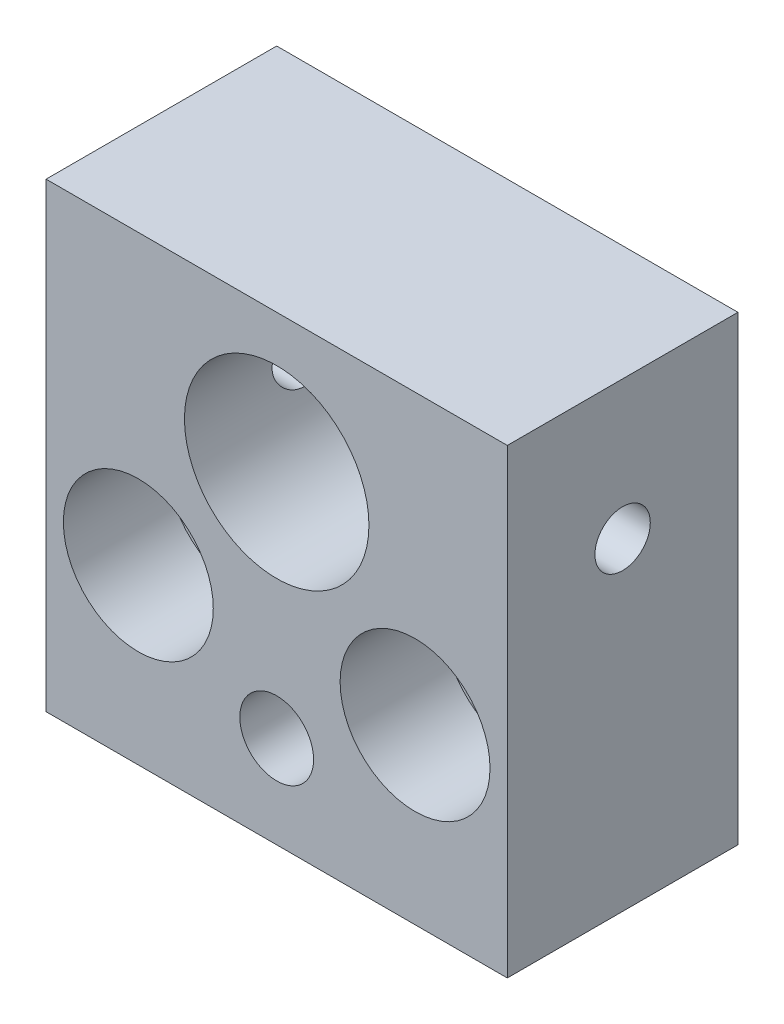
ISO-10303-21;
HEADER;
FILE_DESCRIPTION(('STEP AP214'),'2;1');
FILE_NAME('part.step','',(''),(''),'','','');
FILE_SCHEMA(('AUTOMOTIVE_DESIGN { 1 0 10303 214 1 1 1 1 }'));
ENDSEC;
DATA;
#1=APPLICATION_CONTEXT('core data for automotive mechanical design processes');
#2=APPLICATION_PROTOCOL_DEFINITION('international standard','automotive_design',2000,#1);
#3=PRODUCT_CONTEXT('',#1,'mechanical');
#4=PRODUCT('Part','Part','',(#3));
#5=PRODUCT_RELATED_PRODUCT_CATEGORY('part','',(#4));
#6=PRODUCT_DEFINITION_FORMATION('','',#4);
#7=PRODUCT_DEFINITION_CONTEXT('part definition',#1,'design');
#8=PRODUCT_DEFINITION('design','',#6,#7);
#9=PRODUCT_DEFINITION_SHAPE('','',#8);
#10=(LENGTH_UNIT() NAMED_UNIT(*) SI_UNIT(.MILLI.,.METRE.));
#11=(NAMED_UNIT(*) PLANE_ANGLE_UNIT() SI_UNIT($,.RADIAN.));
#12=(NAMED_UNIT(*) SI_UNIT($,.STERADIAN.) SOLID_ANGLE_UNIT());
#13=UNCERTAINTY_MEASURE_WITH_UNIT(LENGTH_MEASURE(1.E-05),#10,'distance_accuracy_value','');
#14=(GEOMETRIC_REPRESENTATION_CONTEXT(3) GLOBAL_UNCERTAINTY_ASSIGNED_CONTEXT((#13)) GLOBAL_UNIT_ASSIGNED_CONTEXT((#10,
#11,#12)) REPRESENTATION_CONTEXT('',''));
#15=CARTESIAN_POINT('',(0.,0.,0.));
#16=DIRECTION('',(0.,0.,1.));
#17=DIRECTION('',(1.,0.,0.));
#18=AXIS2_PLACEMENT_3D('',#15,#16,#17);
#19=CARTESIAN_POINT('',(-10.,18.5,10.));
#20=DIRECTION('',(0.,0.,1.));
#21=DIRECTION('',(1.,0.,0.));
#22=AXIS2_PLACEMENT_3D('',#19,#20,#21);
#23=PLANE('',#22);
#24=CARTESIAN_POINT('',(0.,22.5,10.));
#25=DIRECTION('',(0.,0.,1.));
#26=DIRECTION('',(1.,0.,0.));
#27=AXIS2_PLACEMENT_3D('',#24,#25,#26);
#28=CIRCLE('',#27,1.59999999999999);
#29=CARTESIAN_POINT('',(1.59999999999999,22.5,10.));
#30=VERTEX_POINT('',#29);
#31=EDGE_CURVE('E195',#30,#30,#28,.T.);
#32=ORIENTED_EDGE('',*,*,#31,.F.);
#33=EDGE_LOOP('',(#32));
#34=FACE_BOUND('',#33,.T.);
#35=CARTESIAN_POINT('',(-6.00000000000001,26.,10.));
#36=DIRECTION('',(0.,0.,1.));
#37=DIRECTION('',(1.,0.,0.));
#38=AXIS2_PLACEMENT_3D('',#35,#36,#37);
#39=CIRCLE('',#38,3.25);
#40=CARTESIAN_POINT('',(-2.75000000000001,26.,10.));
#41=VERTEX_POINT('',#40);
#42=EDGE_CURVE('E198',#41,#41,#39,.T.);
#43=ORIENTED_EDGE('',*,*,#42,.F.);
#44=EDGE_LOOP('',(#43));
#45=FACE_BOUND('',#44,.T.);
#46=CARTESIAN_POINT('',(6.,26.,10.));
#47=DIRECTION('',(0.,0.,1.));
#48=DIRECTION('',(1.,0.,0.));
#49=AXIS2_PLACEMENT_3D('',#46,#47,#48);
#50=CIRCLE('',#49,3.25);
#51=CARTESIAN_POINT('',(9.24999999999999,26.,10.));
#52=VERTEX_POINT('',#51);
#53=EDGE_CURVE('E210',#52,#52,#50,.T.);
#54=ORIENTED_EDGE('',*,*,#53,.F.);
#55=EDGE_LOOP('',(#54));
#56=FACE_BOUND('',#55,.T.);
#57=DIRECTION('',(0.,-1.,0.));
#58=VECTOR('',#57,1.);
#59=CARTESIAN_POINT('',(-10.,38.5,10.));
#60=LINE('',#59,#58);
#61=CARTESIAN_POINT('',(-10.,38.5,10.));
#62=VERTEX_POINT('',#61);
#63=CARTESIAN_POINT('',(-10.,18.5,10.));
#64=VERTEX_POINT('',#63);
#65=EDGE_CURVE('E103',#62,#64,#60,.T.);
#66=ORIENTED_EDGE('',*,*,#65,.T.);
#67=DIRECTION('',(1.,0.,0.));
#68=VECTOR('',#67,1.);
#69=CARTESIAN_POINT('',(-10.,18.5,10.));
#70=LINE('',#69,#68);
#71=CARTESIAN_POINT('',(10.,18.5,10.));
#72=VERTEX_POINT('',#71);
#73=EDGE_CURVE('E88',#64,#72,#70,.T.);
#74=ORIENTED_EDGE('',*,*,#73,.T.);
#75=DIRECTION('',(0.,1.,0.));
#76=VECTOR('',#75,1.);
#77=CARTESIAN_POINT('',(10.,38.5,10.));
#78=LINE('',#77,#76);
#79=CARTESIAN_POINT('',(10.,38.5,10.));
#80=VERTEX_POINT('',#79);
#81=EDGE_CURVE('E54',#72,#80,#78,.T.);
#82=ORIENTED_EDGE('',*,*,#81,.T.);
#83=DIRECTION('',(-1.,0.,0.));
#84=VECTOR('',#83,1.);
#85=CARTESIAN_POINT('',(-10.,38.5,10.));
#86=LINE('',#85,#84);
#87=EDGE_CURVE('E49',#80,#62,#86,.T.);
#88=ORIENTED_EDGE('',*,*,#87,.T.);
#89=EDGE_LOOP('',(#66,#74,#82,#88));
#90=FACE_BOUND('',#89,.T.);
#91=CARTESIAN_POINT('',(0.,32.5,10.));
#92=DIRECTION('',(0.,0.,1.));
#93=DIRECTION('',(1.,0.,0.));
#94=AXIS2_PLACEMENT_3D('',#91,#92,#93);
#95=CIRCLE('',#94,4.);
#96=CARTESIAN_POINT('',(4.,32.5,10.));
#97=VERTEX_POINT('',#96);
#98=EDGE_CURVE('E93',#97,#97,#95,.T.);
#99=ORIENTED_EDGE('',*,*,#98,.F.);
#100=EDGE_LOOP('',(#99));
#101=FACE_BOUND('',#100,.T.);
#102=ADVANCED_FACE('F28',(#34,#45,#56,#90,#101),#23,.T.);
#103=CARTESIAN_POINT('',(-10.,18.5,0.));
#104=DIRECTION('',(0.,0.,1.));
#105=DIRECTION('',(1.,0.,0.));
#106=AXIS2_PLACEMENT_3D('',#103,#104,#105);
#107=PLANE('',#106);
#108=CARTESIAN_POINT('',(0.,22.5,0.));
#109=DIRECTION('',(0.,0.,1.));
#110=DIRECTION('',(1.,0.,0.));
#111=AXIS2_PLACEMENT_3D('',#108,#109,#110);
#112=CIRCLE('',#111,1.6);
#113=CARTESIAN_POINT('',(1.6,22.5,0.));
#114=VERTEX_POINT('',#113);
#115=EDGE_CURVE('E192',#114,#114,#112,.T.);
#116=ORIENTED_EDGE('',*,*,#115,.T.);
#117=EDGE_LOOP('',(#116));
#118=FACE_BOUND('',#117,.T.);
#119=CARTESIAN_POINT('',(-6.00000000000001,26.,0.));
#120=DIRECTION('',(0.,0.,1.));
#121=DIRECTION('',(1.,0.,0.));
#122=AXIS2_PLACEMENT_3D('',#119,#120,#121);
#123=CIRCLE('',#122,1.7);
#124=CARTESIAN_POINT('',(-4.30000000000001,26.,0.));
#125=VERTEX_POINT('',#124);
#126=EDGE_CURVE('E207',#125,#125,#123,.T.);
#127=ORIENTED_EDGE('',*,*,#126,.T.);
#128=EDGE_LOOP('',(#127));
#129=FACE_BOUND('',#128,.T.);
#130=CARTESIAN_POINT('',(6.,26.,0.));
#131=DIRECTION('',(0.,0.,1.));
#132=DIRECTION('',(1.,0.,0.));
#133=AXIS2_PLACEMENT_3D('',#130,#131,#132);
#134=CIRCLE('',#133,1.7);
#135=CARTESIAN_POINT('',(7.7,26.,0.));
#136=VERTEX_POINT('',#135);
#137=EDGE_CURVE('E219',#136,#136,#134,.T.);
#138=ORIENTED_EDGE('',*,*,#137,.T.);
#139=EDGE_LOOP('',(#138));
#140=FACE_BOUND('',#139,.T.);
#141=DIRECTION('',(0.,-1.,0.));
#142=VECTOR('',#141,1.);
#143=CARTESIAN_POINT('',(-10.,38.5,0.));
#144=LINE('',#143,#142);
#145=CARTESIAN_POINT('',(-10.,38.5,0.));
#146=VERTEX_POINT('',#145);
#147=CARTESIAN_POINT('',(-10.,18.5,0.));
#148=VERTEX_POINT('',#147);
#149=EDGE_CURVE('E80',#146,#148,#144,.T.);
#150=ORIENTED_EDGE('',*,*,#149,.F.);
#151=DIRECTION('',(-1.,0.,0.));
#152=VECTOR('',#151,1.);
#153=CARTESIAN_POINT('',(-10.,38.5,0.));
#154=LINE('',#153,#152);
#155=CARTESIAN_POINT('',(10.,38.5,0.));
#156=VERTEX_POINT('',#155);
#157=EDGE_CURVE('E101',#156,#146,#154,.T.);
#158=ORIENTED_EDGE('',*,*,#157,.F.);
#159=DIRECTION('',(0.,1.,0.));
#160=VECTOR('',#159,1.);
#161=CARTESIAN_POINT('',(10.,38.5,0.));
#162=LINE('',#161,#160);
#163=CARTESIAN_POINT('',(10.,18.5,0.));
#164=VERTEX_POINT('',#163);
#165=EDGE_CURVE('E81',#164,#156,#162,.T.);
#166=ORIENTED_EDGE('',*,*,#165,.F.);
#167=DIRECTION('',(1.,0.,0.));
#168=VECTOR('',#167,1.);
#169=CARTESIAN_POINT('',(-10.,18.5,0.));
#170=LINE('',#169,#168);
#171=EDGE_CURVE('E75',#148,#164,#170,.T.);
#172=ORIENTED_EDGE('',*,*,#171,.F.);
#173=EDGE_LOOP('',(#150,#158,#166,#172));
#174=FACE_BOUND('',#173,.T.);
#175=CARTESIAN_POINT('',(0.,32.5,0.));
#176=DIRECTION('',(0.,0.,1.));
#177=DIRECTION('',(1.,0.,0.));
#178=AXIS2_PLACEMENT_3D('',#175,#176,#177);
#179=CIRCLE('',#178,4.);
#180=CARTESIAN_POINT('',(4.,32.5,0.));
#181=VERTEX_POINT('',#180);
#182=EDGE_CURVE('E96',#181,#181,#179,.T.);
#183=ORIENTED_EDGE('',*,*,#182,.T.);
#184=EDGE_LOOP('',(#183));
#185=FACE_BOUND('',#184,.T.);
#186=ADVANCED_FACE('F76',(#118,#129,#140,#174,#185),#107,.F.);
#187=CARTESIAN_POINT('',(-10.,38.5,10.));
#188=DIRECTION('',(1.,0.,0.));
#189=DIRECTION('',(0.,0.,-1.));
#190=AXIS2_PLACEMENT_3D('',#187,#188,#189);
#191=PLANE('',#190);
#192=CARTESIAN_POINT('',(-10.,32.5,5.));
#193=DIRECTION('',(1.,0.,0.));
#194=DIRECTION('',(0.,0.,-1.));
#195=AXIS2_PLACEMENT_3D('',#192,#193,#194);
#196=CIRCLE('',#195,1.19999999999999);
#197=CARTESIAN_POINT('',(-10.,32.5,3.80000000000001));
#198=VERTEX_POINT('',#197);
#199=EDGE_CURVE('E186',#198,#198,#196,.T.);
#200=ORIENTED_EDGE('',*,*,#199,.T.);
#201=EDGE_LOOP('',(#200));
#202=FACE_BOUND('',#201,.T.);
#203=ORIENTED_EDGE('',*,*,#149,.T.);
#204=DIRECTION('',(0.,0.,-1.));
#205=VECTOR('',#204,1.);
#206=CARTESIAN_POINT('',(-10.,18.5,10.));
#207=LINE('',#206,#205);
#208=EDGE_CURVE('E11',#64,#148,#207,.T.);
#209=ORIENTED_EDGE('',*,*,#208,.F.);
#210=ORIENTED_EDGE('',*,*,#65,.F.);
#211=DIRECTION('',(0.,0.,-1.));
#212=VECTOR('',#211,1.);
#213=CARTESIAN_POINT('',(-10.,38.5,10.));
#214=LINE('',#213,#212);
#215=EDGE_CURVE('E92',#62,#146,#214,.T.);
#216=ORIENTED_EDGE('',*,*,#215,.T.);
#217=EDGE_LOOP('',(#203,#209,#210,#216));
#218=FACE_BOUND('',#217,.T.);
#219=ADVANCED_FACE('F30',(#202,#218),#191,.F.);
#220=CARTESIAN_POINT('',(-10.,18.5,10.));
#221=DIRECTION('',(0.,1.,0.));
#222=DIRECTION('',(0.,0.,1.));
#223=AXIS2_PLACEMENT_3D('',#220,#221,#222);
#224=PLANE('',#223);
#225=ORIENTED_EDGE('',*,*,#171,.T.);
#226=DIRECTION('',(0.,0.,-1.));
#227=VECTOR('',#226,1.);
#228=CARTESIAN_POINT('',(10.,18.5,10.));
#229=LINE('',#228,#227);
#230=EDGE_CURVE('E41',#72,#164,#229,.T.);
#231=ORIENTED_EDGE('',*,*,#230,.F.);
#232=ORIENTED_EDGE('',*,*,#73,.F.);
#233=ORIENTED_EDGE('',*,*,#208,.T.);
#234=EDGE_LOOP('',(#225,#231,#232,#233));
#235=FACE_BOUND('',#234,.T.);
#236=ADVANCED_FACE('F87',(#235),#224,.F.);
#237=CARTESIAN_POINT('',(10.,38.5,10.));
#238=DIRECTION('',(-1.,0.,0.));
#239=DIRECTION('',(0.,-1.,0.));
#240=AXIS2_PLACEMENT_3D('',#237,#238,#239);
#241=PLANE('',#240);
#242=CARTESIAN_POINT('',(10.,32.5,5.));
#243=DIRECTION('',(1.,0.,0.));
#244=DIRECTION('',(0.,0.,-1.));
#245=AXIS2_PLACEMENT_3D('',#242,#243,#244);
#246=CIRCLE('',#245,1.19999999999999);
#247=CARTESIAN_POINT('',(10.,32.5,3.80000000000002));
#248=VERTEX_POINT('',#247);
#249=EDGE_CURVE('E116',#248,#248,#246,.T.);
#250=ORIENTED_EDGE('',*,*,#249,.F.);
#251=EDGE_LOOP('',(#250));
#252=FACE_BOUND('',#251,.T.);
#253=ORIENTED_EDGE('',*,*,#165,.T.);
#254=DIRECTION('',(0.,0.,-1.));
#255=VECTOR('',#254,1.);
#256=CARTESIAN_POINT('',(10.,38.5,10.));
#257=LINE('',#256,#255);
#258=EDGE_CURVE('E109',#80,#156,#257,.T.);
#259=ORIENTED_EDGE('',*,*,#258,.F.);
#260=ORIENTED_EDGE('',*,*,#81,.F.);
#261=ORIENTED_EDGE('',*,*,#230,.T.);
#262=EDGE_LOOP('',(#253,#259,#260,#261));
#263=FACE_BOUND('',#262,.T.);
#264=ADVANCED_FACE('F173',(#252,#263),#241,.F.);
#265=CARTESIAN_POINT('',(-10.,38.5,10.));
#266=DIRECTION('',(0.,-1.,0.));
#267=DIRECTION('',(0.,0.,-1.));
#268=AXIS2_PLACEMENT_3D('',#265,#266,#267);
#269=PLANE('',#268);
#270=ORIENTED_EDGE('',*,*,#157,.T.);
#271=ORIENTED_EDGE('',*,*,#215,.F.);
#272=ORIENTED_EDGE('',*,*,#87,.F.);
#273=ORIENTED_EDGE('',*,*,#258,.T.);
#274=EDGE_LOOP('',(#270,#271,#272,#273));
#275=FACE_BOUND('',#274,.T.);
#276=ADVANCED_FACE('F157',(#275),#269,.F.);
#277=CARTESIAN_POINT('',(0.,32.5,10.));
#278=DIRECTION('',(0.,0.,-1.));
#279=DIRECTION('',(-1.,0.,0.));
#280=AXIS2_PLACEMENT_3D('',#277,#278,#279);
#281=CYLINDRICAL_SURFACE('',#280,4.);
#282=CARTESIAN_POINT('',(-4.,32.5,6.19999999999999));
#283=CARTESIAN_POINT('',(-3.9999994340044,32.4341691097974,6.19999920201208));
#284=CARTESIAN_POINT('',(-3.99835932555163,32.3683301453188,6.19456490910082));
#285=CARTESIAN_POINT('',(-3.99197684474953,32.2385694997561,6.17302291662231));
#286=CARTESIAN_POINT('',(-3.98723354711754,32.1746483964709,6.15691203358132));
#287=CARTESIAN_POINT('',(-3.97516442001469,32.0506138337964,6.11460318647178));
#288=CARTESIAN_POINT('',(-3.9678424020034,31.9904949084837,6.08842010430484));
#289=CARTESIAN_POINT('',(-3.95137687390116,31.8755006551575,6.02677112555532));
#290=CARTESIAN_POINT('',(-3.94223312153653,31.8206260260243,5.99130399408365));
#291=CARTESIAN_POINT('',(-3.92280589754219,31.716102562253,5.91102079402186));
#292=CARTESIAN_POINT('',(-3.91249906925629,31.6666255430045,5.86598669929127));
#293=CARTESIAN_POINT('',(-3.89204667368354,31.5758006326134,5.76831261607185));
#294=CARTESIAN_POINT('',(-3.88190113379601,31.5344541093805,5.71567135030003));
#295=CARTESIAN_POINT('',(-3.86267291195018,31.4601596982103,5.60282339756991));
#296=CARTESIAN_POINT('',(-3.853619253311,31.4274215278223,5.54247323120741));
#297=CARTESIAN_POINT('',(-3.83794896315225,31.3726288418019,5.41680859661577));
#298=CARTESIAN_POINT('',(-3.83133174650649,31.3505717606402,5.35149532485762));
#299=CARTESIAN_POINT('',(-3.82152696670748,31.3183869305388,5.21968778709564));
#300=CARTESIAN_POINT('',(-3.81824855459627,31.3079424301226,5.15327780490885));
#301=CARTESIAN_POINT('',(-3.81522231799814,31.2982901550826,5.0195734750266));
#302=CARTESIAN_POINT('',(-3.81547363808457,31.2990796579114,4.95227934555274));
#303=CARTESIAN_POINT('',(-3.81939795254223,31.3116241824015,4.82129287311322));
#304=CARTESIAN_POINT('',(-3.82294710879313,31.3229823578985,4.75755819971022));
#305=CARTESIAN_POINT('',(-3.832866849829,31.3557006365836,4.63294417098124));
#306=CARTESIAN_POINT('',(-3.83923771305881,31.3770617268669,4.57206509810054));
#307=CARTESIAN_POINT('',(-3.85418186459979,31.4294717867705,4.45391972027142));
#308=CARTESIAN_POINT('',(-3.86278412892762,31.4606494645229,4.3967143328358));
#309=CARTESIAN_POINT('',(-3.88120789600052,31.5317182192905,4.28821438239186));
#310=CARTESIAN_POINT('',(-3.89102969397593,31.5716114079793,4.23692125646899));
#311=CARTESIAN_POINT('',(-3.9112880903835,31.6609496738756,4.13945104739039));
#312=CARTESIAN_POINT('',(-3.92173323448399,31.7107240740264,4.09357706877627));
#313=CARTESIAN_POINT('',(-3.94169795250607,31.8173893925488,4.01075681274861));
#314=CARTESIAN_POINT('',(-3.95121746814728,31.8742807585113,3.97381109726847));
#315=CARTESIAN_POINT('',(-3.96834528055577,31.9941159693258,3.90971206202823));
#316=CARTESIAN_POINT('',(-3.97594034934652,32.0570978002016,3.88262598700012));
#317=CARTESIAN_POINT('',(-3.98826817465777,32.1870036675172,3.83952032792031));
#318=CARTESIAN_POINT('',(-3.99300172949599,32.2539265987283,3.82349765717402));
#319=CARTESIAN_POINT('',(-3.99894691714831,32.3872382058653,3.8034782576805));
#320=CARTESIAN_POINT('',(-4.00027880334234,32.4535599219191,3.79907073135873));
#321=CARTESIAN_POINT('',(-3.99962338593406,32.5859996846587,3.80125532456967));
#322=CARTESIAN_POINT('',(-3.99763652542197,32.6521177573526,3.80784597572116));
#323=CARTESIAN_POINT('',(-3.99064557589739,32.7807228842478,3.83150768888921));
#324=CARTESIAN_POINT('',(-3.98571063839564,32.8432582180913,3.84833871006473));
#325=CARTESIAN_POINT('',(-3.97339478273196,32.9646037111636,3.89171458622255));
#326=CARTESIAN_POINT('',(-3.96601357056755,33.0234134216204,3.91826060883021));
#327=CARTESIAN_POINT('',(-3.94935723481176,33.1371497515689,3.98100253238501));
#328=CARTESIAN_POINT('',(-3.94004224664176,33.1919550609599,4.01740747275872));
#329=CARTESIAN_POINT('',(-3.92058775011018,33.294818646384,4.09857980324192));
#330=CARTESIAN_POINT('',(-3.91044803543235,33.3428752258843,4.14334928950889));
#331=CARTESIAN_POINT('',(-3.89002537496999,33.4326859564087,4.24190984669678));
#332=CARTESIAN_POINT('',(-3.87975060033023,33.4741478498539,4.29596950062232));
#333=CARTESIAN_POINT('',(-3.86061212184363,33.5474319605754,4.41050235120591));
#334=CARTESIAN_POINT('',(-3.85174838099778,33.5792544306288,4.47097537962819));
#335=CARTESIAN_POINT('',(-3.83653751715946,33.6321387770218,4.59642599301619));
#336=CARTESIAN_POINT('',(-3.8301787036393,33.6532507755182,4.66138094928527));
#337=CARTESIAN_POINT('',(-3.82073275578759,33.6841738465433,4.79415037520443));
#338=CARTESIAN_POINT('',(-3.81764450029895,33.693988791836,4.86196385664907));
#339=CARTESIAN_POINT('',(-3.81519977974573,33.7017758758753,4.99548921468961));
#340=CARTESIAN_POINT('',(-3.81569317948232,33.7002244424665,5.06117092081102));
#341=CARTESIAN_POINT('',(-3.81999521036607,33.6864600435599,5.19129128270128));
#342=CARTESIAN_POINT('',(-3.82380370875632,33.6742475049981,5.25572998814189));
#343=CARTESIAN_POINT('',(-3.83420610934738,33.6398151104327,5.38075631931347));
#344=CARTESIAN_POINT('',(-3.84076483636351,33.6177214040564,5.44138182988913));
#345=CARTESIAN_POINT('',(-3.85592223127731,33.5642520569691,5.55811395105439));
#346=CARTESIAN_POINT('',(-3.86452128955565,33.532874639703,5.61421969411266));
#347=CARTESIAN_POINT('',(-3.88318141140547,33.4603901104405,5.72253049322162));
#348=CARTESIAN_POINT('',(-3.89328432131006,33.4189702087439,5.77451900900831));
#349=CARTESIAN_POINT('',(-3.91361056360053,33.3281394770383,5.8709619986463));
#350=CARTESIAN_POINT('',(-3.92383392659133,33.2787265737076,5.9154145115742));
#351=CARTESIAN_POINT('',(-3.9436074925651,33.1715726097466,5.99681872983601));
#352=CARTESIAN_POINT('',(-3.95312927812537,33.1136303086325,6.03351315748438));
#353=CARTESIAN_POINT('',(-3.97008544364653,32.9921130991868,6.09658813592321));
#354=CARTESIAN_POINT('',(-3.97752079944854,32.9285408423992,6.1229735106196));
#355=CARTESIAN_POINT('',(-3.9888173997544,32.8046061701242,6.16231622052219));
#356=CARTESIAN_POINT('',(-3.99297621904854,32.7446295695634,6.17640933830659));
#357=CARTESIAN_POINT('',(-3.99856755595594,32.6231041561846,6.19525082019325));
#358=CARTESIAN_POINT('',(-4.00000052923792,32.5615556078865,6.20000074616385));
#359=CARTESIAN_POINT('',(-4.,32.5,6.19999999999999));
#360=B_SPLINE_CURVE_WITH_KNOTS('',3,(#282,#283,#284,#285,#286,#287,#288,#289,#290,#291,#292,
#293,#294,#295,#296,#297,#298,#299,#300,#301,#302,#303,#304,#305,#306,#307,#308,#309,#310,#311,
#312,#313,#314,#315,#316,#317,#318,#319,#320,#321,#322,#323,#324,#325,#326,#327,#328,#329,#330,
#331,#332,#333,#334,#335,#336,#337,#338,#339,#340,#341,#342,#343,#344,#345,#346,#347,#348,#349,
#350,#351,#352,#353,#354,#355,#356,#357,#358,#359),.UNSPECIFIED.,.T.,.F.,(4,2,2,2,2,2,2,2,2,2,2,
2,2,2,2,2,2,2,2,2,2,2,2,2,2,2,2,2,2,2,2,2,2,2,2,2,2,2,4),(0.,0.197266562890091,
0.394591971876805,0.591626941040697,0.78868813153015,0.990844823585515,1.19303549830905,
1.39977184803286,1.60645851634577,1.80735751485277,2.00820782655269,2.20180813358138,
2.39542754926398,2.59169941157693,2.78801888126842,2.99253683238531,3.19706765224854,
3.40296837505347,3.60881162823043,3.80727047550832,4.00570282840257,4.19965397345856,
4.39362843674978,4.59209044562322,4.79060225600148,4.9963232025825,5.20203875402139,
5.40678251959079,5.61145607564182,5.8076012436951,6.00373855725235,6.19744032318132,
6.3911791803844,6.59197540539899,6.79282379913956,6.9995439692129,7.20616729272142,
7.39065353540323,7.57510893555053),.UNSPECIFIED.);
#361=CARTESIAN_POINT('',(-4.,32.5,6.19999999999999));
#362=VERTEX_POINT('',#361);
#363=EDGE_CURVE('E32',#362,#362,#360,.T.);
#364=ORIENTED_EDGE('',*,*,#363,.F.);
#365=EDGE_LOOP('',(#364));
#366=FACE_BOUND('',#365,.T.);
#367=CARTESIAN_POINT('',(4.,32.5,3.80000000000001));
#368=CARTESIAN_POINT('',(3.9999994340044,32.4341691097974,3.80000079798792));
#369=CARTESIAN_POINT('',(3.99835932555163,32.3683301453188,3.80543509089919));
#370=CARTESIAN_POINT('',(3.99197684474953,32.2385694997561,3.82697708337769));
#371=CARTESIAN_POINT('',(3.98723354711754,32.1746483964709,3.84308796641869));
#372=CARTESIAN_POINT('',(3.97516442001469,32.0506138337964,3.88539681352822));
#373=CARTESIAN_POINT('',(3.9678424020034,31.9904949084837,3.91157989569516));
#374=CARTESIAN_POINT('',(3.95137687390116,31.8755006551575,3.97322887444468));
#375=CARTESIAN_POINT('',(3.94223312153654,31.8206260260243,4.00869600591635));
#376=CARTESIAN_POINT('',(3.9228058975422,31.716102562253,4.08897920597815));
#377=CARTESIAN_POINT('',(3.91249906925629,31.6666255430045,4.13401330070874));
#378=CARTESIAN_POINT('',(3.89204667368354,31.5758006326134,4.23168738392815));
#379=CARTESIAN_POINT('',(3.88190113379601,31.5344541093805,4.28432864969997));
#380=CARTESIAN_POINT('',(3.86267291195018,31.4601596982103,4.39717660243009));
#381=CARTESIAN_POINT('',(3.853619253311,31.4274215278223,4.45752676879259));
#382=CARTESIAN_POINT('',(3.83794896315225,31.3726288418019,4.58319140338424));
#383=CARTESIAN_POINT('',(3.83133174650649,31.3505717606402,4.64850467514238));
#384=CARTESIAN_POINT('',(3.82152696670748,31.3183869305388,4.78031221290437));
#385=CARTESIAN_POINT('',(3.81824855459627,31.3079424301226,4.84672219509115));
#386=CARTESIAN_POINT('',(3.81522231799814,31.2982901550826,4.98042652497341));
#387=CARTESIAN_POINT('',(3.81547363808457,31.2990796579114,5.04772065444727));
#388=CARTESIAN_POINT('',(3.81939795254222,31.3116241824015,5.17870712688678));
#389=CARTESIAN_POINT('',(3.82294710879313,31.3229823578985,5.24244180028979));
#390=CARTESIAN_POINT('',(3.832866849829,31.3557006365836,5.36705582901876));
#391=CARTESIAN_POINT('',(3.83923771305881,31.3770617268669,5.42793490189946));
#392=CARTESIAN_POINT('',(3.85418186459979,31.4294717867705,5.54608027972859));
#393=CARTESIAN_POINT('',(3.86278412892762,31.4606494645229,5.60328566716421));
#394=CARTESIAN_POINT('',(3.88120789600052,31.5317182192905,5.71178561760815));
#395=CARTESIAN_POINT('',(3.89102969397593,31.5716114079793,5.76307874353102));
#396=CARTESIAN_POINT('',(3.9112880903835,31.6609496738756,5.86054895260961));
#397=CARTESIAN_POINT('',(3.92173323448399,31.7107240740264,5.90642293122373));
#398=CARTESIAN_POINT('',(3.94169795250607,31.8173893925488,5.98924318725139));
#399=CARTESIAN_POINT('',(3.95121746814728,31.8742807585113,6.02618890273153));
#400=CARTESIAN_POINT('',(3.96834528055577,31.9941159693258,6.09028793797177));
#401=CARTESIAN_POINT('',(3.97594034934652,32.0570978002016,6.11737401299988));
#402=CARTESIAN_POINT('',(3.98826817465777,32.1870036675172,6.1604796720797));
#403=CARTESIAN_POINT('',(3.99300172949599,32.2539265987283,6.17650234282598));
#404=CARTESIAN_POINT('',(3.99894691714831,32.3872382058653,6.19652174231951));
#405=CARTESIAN_POINT('',(4.00027880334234,32.4535599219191,6.20092926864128));
#406=CARTESIAN_POINT('',(3.99962338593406,32.5859996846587,6.19874467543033));
#407=CARTESIAN_POINT('',(3.99763652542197,32.6521177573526,6.19215402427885));
#408=CARTESIAN_POINT('',(3.99064557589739,32.7807228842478,6.16849231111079));
#409=CARTESIAN_POINT('',(3.98571063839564,32.8432582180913,6.15166128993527));
#410=CARTESIAN_POINT('',(3.97339478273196,32.9646037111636,6.10828541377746));
#411=CARTESIAN_POINT('',(3.96601357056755,33.0234134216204,6.08173939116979));
#412=CARTESIAN_POINT('',(3.94935723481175,33.1371497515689,6.018997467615));
#413=CARTESIAN_POINT('',(3.94004224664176,33.1919550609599,5.98259252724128));
#414=CARTESIAN_POINT('',(3.92058775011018,33.294818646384,5.90142019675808));
#415=CARTESIAN_POINT('',(3.91044803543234,33.3428752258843,5.85665071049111));
#416=CARTESIAN_POINT('',(3.89002537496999,33.4326859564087,5.75809015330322));
#417=CARTESIAN_POINT('',(3.87975060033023,33.4741478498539,5.70403049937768));
#418=CARTESIAN_POINT('',(3.86061212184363,33.5474319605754,5.58949764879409));
#419=CARTESIAN_POINT('',(3.85174838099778,33.5792544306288,5.52902462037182));
#420=CARTESIAN_POINT('',(3.83653751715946,33.6321387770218,5.40357400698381));
#421=CARTESIAN_POINT('',(3.83017870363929,33.6532507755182,5.33861905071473));
#422=CARTESIAN_POINT('',(3.82073275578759,33.6841738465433,5.20584962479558));
#423=CARTESIAN_POINT('',(3.81764450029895,33.693988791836,5.13803614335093));
#424=CARTESIAN_POINT('',(3.81519977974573,33.7017758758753,5.00451078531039));
#425=CARTESIAN_POINT('',(3.81569317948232,33.7002244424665,4.93882907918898));
#426=CARTESIAN_POINT('',(3.81999521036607,33.6864600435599,4.80870871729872));
#427=CARTESIAN_POINT('',(3.82380370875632,33.6742475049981,4.74427001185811));
#428=CARTESIAN_POINT('',(3.83420610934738,33.6398151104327,4.61924368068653));
#429=CARTESIAN_POINT('',(3.84076483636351,33.6177214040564,4.55861817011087));
#430=CARTESIAN_POINT('',(3.85592223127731,33.5642520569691,4.44188604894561));
#431=CARTESIAN_POINT('',(3.86452128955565,33.532874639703,4.38578030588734));
#432=CARTESIAN_POINT('',(3.88318141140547,33.4603901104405,4.27746950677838));
#433=CARTESIAN_POINT('',(3.89328432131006,33.4189702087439,4.2254809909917));
#434=CARTESIAN_POINT('',(3.91361056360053,33.3281394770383,4.1290380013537));
#435=CARTESIAN_POINT('',(3.92383392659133,33.2787265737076,4.0845854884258));
#436=CARTESIAN_POINT('',(3.9436074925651,33.1715726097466,4.00318127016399));
#437=CARTESIAN_POINT('',(3.95312927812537,33.1136303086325,3.96648684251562));
#438=CARTESIAN_POINT('',(3.97008544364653,32.9921130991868,3.90341186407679));
#439=CARTESIAN_POINT('',(3.97752079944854,32.9285408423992,3.87702648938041));
#440=CARTESIAN_POINT('',(3.9888173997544,32.8046061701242,3.83768377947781));
#441=CARTESIAN_POINT('',(3.99297621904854,32.7446295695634,3.82359066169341));
#442=CARTESIAN_POINT('',(3.99856755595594,32.6231041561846,3.80474917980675));
#443=CARTESIAN_POINT('',(4.00000052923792,32.5615556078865,3.79999925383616));
#444=CARTESIAN_POINT('',(4.,32.5,3.80000000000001));
#445=B_SPLINE_CURVE_WITH_KNOTS('',3,(#367,#368,#369,#370,#371,#372,#373,#374,#375,#376,#377,
#378,#379,#380,#381,#382,#383,#384,#385,#386,#387,#388,#389,#390,#391,#392,#393,#394,#395,#396,
#397,#398,#399,#400,#401,#402,#403,#404,#405,#406,#407,#408,#409,#410,#411,#412,#413,#414,#415,
#416,#417,#418,#419,#420,#421,#422,#423,#424,#425,#426,#427,#428,#429,#430,#431,#432,#433,#434,
#435,#436,#437,#438,#439,#440,#441,#442,#443,#444),.UNSPECIFIED.,.T.,.F.,(4,2,2,2,2,2,2,2,2,2,2,
2,2,2,2,2,2,2,2,2,2,2,2,2,2,2,2,2,2,2,2,2,2,2,2,2,2,2,4),(0.,0.197266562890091,
0.394591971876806,0.591626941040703,0.78868813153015,0.990844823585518,1.19303549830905,
1.39977184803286,1.60645851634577,1.80735751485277,2.00820782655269,2.20180813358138,
2.39542754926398,2.59169941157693,2.78801888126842,2.99253683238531,3.19706765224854,
3.40296837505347,3.60881162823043,3.80727047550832,4.00570282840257,4.19965397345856,
4.39362843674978,4.59209044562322,4.79060225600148,4.9963232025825,5.20203875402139,
5.40678251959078,5.61145607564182,5.8076012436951,6.00373855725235,6.19744032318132,
6.3911791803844,6.59197540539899,6.79282379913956,6.99954396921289,7.20616729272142,
7.39065353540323,7.57510893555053),.UNSPECIFIED.);
#446=CARTESIAN_POINT('',(4.,32.5,3.80000000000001));
#447=VERTEX_POINT('',#446);
#448=EDGE_CURVE('E112',#447,#447,#445,.T.);
#449=ORIENTED_EDGE('',*,*,#448,.F.);
#450=EDGE_LOOP('',(#449));
#451=FACE_BOUND('',#450,.T.);
#452=ORIENTED_EDGE('',*,*,#98,.T.);
#453=EDGE_LOOP('',(#452));
#454=FACE_BOUND('',#453,.T.);
#455=ORIENTED_EDGE('',*,*,#182,.F.);
#456=EDGE_LOOP('',(#455));
#457=FACE_BOUND('',#456,.T.);
#458=ADVANCED_FACE('F117',(#366,#451,#454,#457),#281,.F.);
#459=CARTESIAN_POINT('',(6.,26.,10.));
#460=DIRECTION('',(0.,0.,1.));
#461=DIRECTION('',(1.,0.,0.));
#462=AXIS2_PLACEMENT_3D('',#459,#460,#461);
#463=CYLINDRICAL_SURFACE('',#462,1.7);
#464=ORIENTED_EDGE('',*,*,#137,.F.);
#465=EDGE_LOOP('',(#464));
#466=FACE_BOUND('',#465,.T.);
#467=CARTESIAN_POINT('',(6.,26.,5.5));
#468=DIRECTION('',(0.,0.,1.));
#469=DIRECTION('',(1.,0.,0.));
#470=AXIS2_PLACEMENT_3D('',#467,#468,#469);
#471=CIRCLE('',#470,1.7);
#472=CARTESIAN_POINT('',(7.7,26.,5.5));
#473=VERTEX_POINT('',#472);
#474=EDGE_CURVE('E216',#473,#473,#471,.T.);
#475=ORIENTED_EDGE('',*,*,#474,.T.);
#476=EDGE_LOOP('',(#475));
#477=FACE_BOUND('',#476,.T.);
#478=ADVANCED_FACE('F150',(#466,#477),#463,.F.);
#479=CARTESIAN_POINT('',(7.7,26.,5.5));
#480=DIRECTION('',(0.,0.,-1.));
#481=DIRECTION('',(-1.,0.,0.));
#482=AXIS2_PLACEMENT_3D('',#479,#480,#481);
#483=PLANE('',#482);
#484=ORIENTED_EDGE('',*,*,#474,.F.);
#485=EDGE_LOOP('',(#484));
#486=FACE_BOUND('',#485,.T.);
#487=CARTESIAN_POINT('',(6.,26.,5.5));
#488=DIRECTION('',(0.,0.,1.));
#489=DIRECTION('',(1.,0.,0.));
#490=AXIS2_PLACEMENT_3D('',#487,#488,#489);
#491=CIRCLE('',#490,3.25);
#492=CARTESIAN_POINT('',(9.25,26.,5.5));
#493=VERTEX_POINT('',#492);
#494=EDGE_CURVE('E213',#493,#493,#491,.T.);
#495=ORIENTED_EDGE('',*,*,#494,.T.);
#496=EDGE_LOOP('',(#495));
#497=FACE_BOUND('',#496,.T.);
#498=ADVANCED_FACE('F147',(#486,#497),#483,.F.);
#499=CARTESIAN_POINT('',(6.,26.,10.));
#500=DIRECTION('',(0.,0.,1.));
#501=DIRECTION('',(1.,0.,0.));
#502=AXIS2_PLACEMENT_3D('',#499,#500,#501);
#503=CYLINDRICAL_SURFACE('',#502,3.25);
#504=ORIENTED_EDGE('',*,*,#494,.F.);
#505=EDGE_LOOP('',(#504));
#506=FACE_BOUND('',#505,.T.);
#507=ORIENTED_EDGE('',*,*,#53,.T.);
#508=EDGE_LOOP('',(#507));
#509=FACE_BOUND('',#508,.T.);
#510=ADVANCED_FACE('F143',(#506,#509),#503,.F.);
#511=CARTESIAN_POINT('',(-6.00000000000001,26.,10.));
#512=DIRECTION('',(0.,0.,1.));
#513=DIRECTION('',(1.,0.,0.));
#514=AXIS2_PLACEMENT_3D('',#511,#512,#513);
#515=CYLINDRICAL_SURFACE('',#514,1.7);
#516=ORIENTED_EDGE('',*,*,#126,.F.);
#517=EDGE_LOOP('',(#516));
#518=FACE_BOUND('',#517,.T.);
#519=CARTESIAN_POINT('',(-6.00000000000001,26.,5.5));
#520=DIRECTION('',(0.,0.,1.));
#521=DIRECTION('',(1.,0.,0.));
#522=AXIS2_PLACEMENT_3D('',#519,#520,#521);
#523=CIRCLE('',#522,1.7);
#524=CARTESIAN_POINT('',(-4.30000000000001,26.,5.5));
#525=VERTEX_POINT('',#524);
#526=EDGE_CURVE('E204',#525,#525,#523,.T.);
#527=ORIENTED_EDGE('',*,*,#526,.T.);
#528=EDGE_LOOP('',(#527));
#529=FACE_BOUND('',#528,.T.);
#530=ADVANCED_FACE('F139',(#518,#529),#515,.F.);
#531=CARTESIAN_POINT('',(-4.30000000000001,26.,5.5));
#532=DIRECTION('',(0.,0.,-1.));
#533=DIRECTION('',(-1.,0.,0.));
#534=AXIS2_PLACEMENT_3D('',#531,#532,#533);
#535=PLANE('',#534);
#536=ORIENTED_EDGE('',*,*,#526,.F.);
#537=EDGE_LOOP('',(#536));
#538=FACE_BOUND('',#537,.T.);
#539=CARTESIAN_POINT('',(-6.00000000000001,26.,5.5));
#540=DIRECTION('',(0.,0.,1.));
#541=DIRECTION('',(1.,0.,0.));
#542=AXIS2_PLACEMENT_3D('',#539,#540,#541);
#543=CIRCLE('',#542,3.25);
#544=CARTESIAN_POINT('',(-2.75000000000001,26.,5.5));
#545=VERTEX_POINT('',#544);
#546=EDGE_CURVE('E201',#545,#545,#543,.T.);
#547=ORIENTED_EDGE('',*,*,#546,.T.);
#548=EDGE_LOOP('',(#547));
#549=FACE_BOUND('',#548,.T.);
#550=ADVANCED_FACE('F135',(#538,#549),#535,.F.);
#551=CARTESIAN_POINT('',(-6.00000000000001,26.,10.));
#552=DIRECTION('',(0.,0.,1.));
#553=DIRECTION('',(1.,0.,0.));
#554=AXIS2_PLACEMENT_3D('',#551,#552,#553);
#555=CYLINDRICAL_SURFACE('',#554,3.25);
#556=ORIENTED_EDGE('',*,*,#546,.F.);
#557=EDGE_LOOP('',(#556));
#558=FACE_BOUND('',#557,.T.);
#559=ORIENTED_EDGE('',*,*,#42,.T.);
#560=EDGE_LOOP('',(#559));
#561=FACE_BOUND('',#560,.T.);
#562=ADVANCED_FACE('F131',(#558,#561),#555,.F.);
#563=CARTESIAN_POINT('',(0.,22.5,10.));
#564=DIRECTION('',(0.,0.,1.));
#565=DIRECTION('',(1.,0.,0.));
#566=AXIS2_PLACEMENT_3D('',#563,#564,#565);
#567=CYLINDRICAL_SURFACE('',#566,1.59999999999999);
#568=ORIENTED_EDGE('',*,*,#115,.F.);
#569=EDGE_LOOP('',(#568));
#570=FACE_BOUND('',#569,.T.);
#571=ORIENTED_EDGE('',*,*,#31,.T.);
#572=EDGE_LOOP('',(#571));
#573=FACE_BOUND('',#572,.T.);
#574=ADVANCED_FACE('F126',(#570,#573),#567,.F.);
#575=CARTESIAN_POINT('',(10.,32.5,5.));
#576=DIRECTION('',(1.,0.,0.));
#577=DIRECTION('',(0.,0.,-1.));
#578=AXIS2_PLACEMENT_3D('',#575,#576,#577);
#579=CYLINDRICAL_SURFACE('',#578,1.19999999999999);
#580=ORIENTED_EDGE('',*,*,#448,.T.);
#581=EDGE_LOOP('',(#580));
#582=FACE_BOUND('',#581,.T.);
#583=ORIENTED_EDGE('',*,*,#249,.T.);
#584=EDGE_LOOP('',(#583));
#585=FACE_BOUND('',#584,.T.);
#586=ADVANCED_FACE('F121',(#582,#585),#579,.F.);
#587=ORIENTED_EDGE('',*,*,#363,.T.);
#588=EDGE_LOOP('',(#587));
#589=FACE_BOUND('',#588,.T.);
#590=ORIENTED_EDGE('',*,*,#199,.F.);
#591=EDGE_LOOP('',(#590));
#592=FACE_BOUND('',#591,.T.);
#593=ADVANCED_FACE('F125',(#589,#592),#579,.F.);
#594=CLOSED_SHELL('',(#102,#186,#219,#236,#264,#276,#458,#478,#498,#510,#530,#550,#562,#574,
#586,#593));
#595=MANIFOLD_SOLID_BREP('B2',#594);
#596=ADVANCED_BREP_SHAPE_REPRESENTATION('',(#18,#595),#14);
#597=SHAPE_DEFINITION_REPRESENTATION(#9,#596);
ENDSEC;
END-ISO-10303-21;
